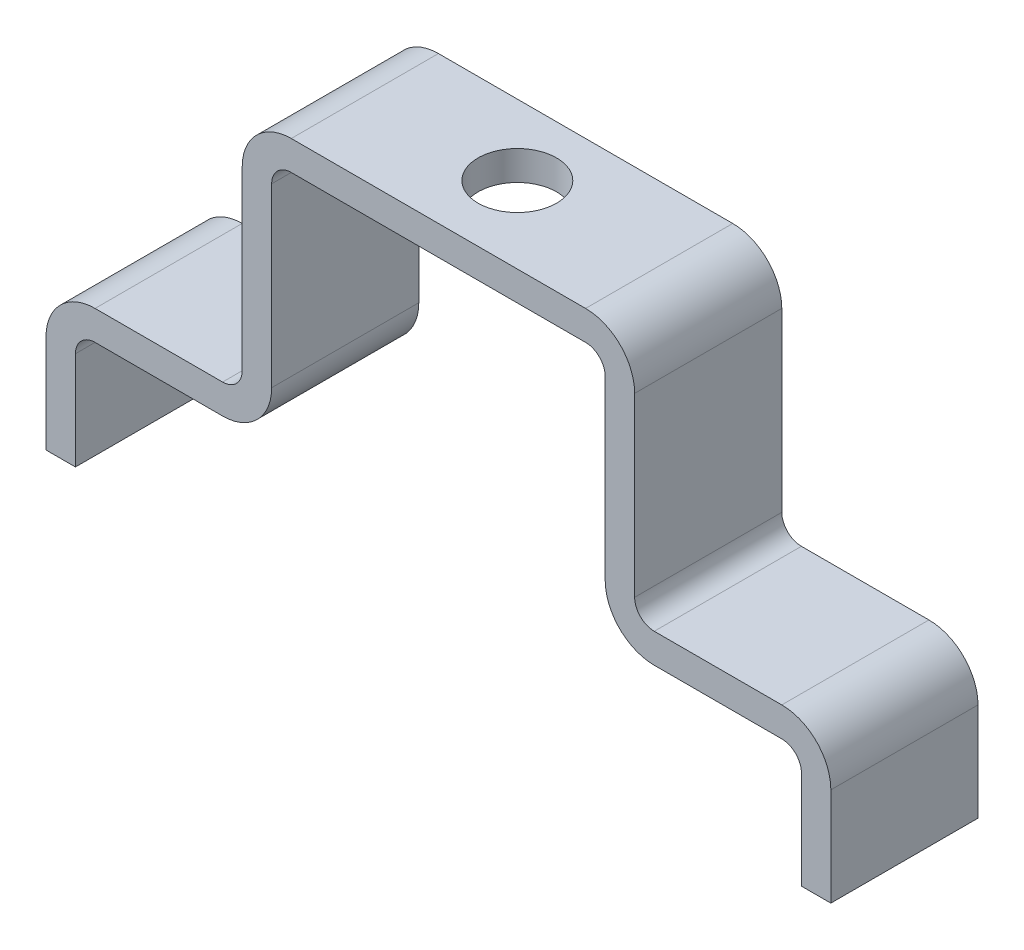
ISO-10303-21;
HEADER;
FILE_DESCRIPTION(('STEP AP214'),'2;1');
FILE_NAME('part.step','',(''),(''),'','','');
FILE_SCHEMA(('AUTOMOTIVE_DESIGN { 1 0 10303 214 1 1 1 1 }'));
ENDSEC;
DATA;
#1=APPLICATION_CONTEXT('core data for automotive mechanical design processes');
#2=APPLICATION_PROTOCOL_DEFINITION('international standard','automotive_design',2000,#1);
#3=PRODUCT_CONTEXT('',#1,'mechanical');
#4=PRODUCT('Part','Part','',(#3));
#5=PRODUCT_RELATED_PRODUCT_CATEGORY('part','',(#4));
#6=PRODUCT_DEFINITION_FORMATION('','',#4);
#7=PRODUCT_DEFINITION_CONTEXT('part definition',#1,'design');
#8=PRODUCT_DEFINITION('design','',#6,#7);
#9=PRODUCT_DEFINITION_SHAPE('','',#8);
#10=(LENGTH_UNIT() NAMED_UNIT(*) SI_UNIT(.MILLI.,.METRE.));
#11=(NAMED_UNIT(*) PLANE_ANGLE_UNIT() SI_UNIT($,.RADIAN.));
#12=(NAMED_UNIT(*) SI_UNIT($,.STERADIAN.) SOLID_ANGLE_UNIT());
#13=UNCERTAINTY_MEASURE_WITH_UNIT(LENGTH_MEASURE(1.E-05),#10,'distance_accuracy_value','');
#14=(GEOMETRIC_REPRESENTATION_CONTEXT(3) GLOBAL_UNCERTAINTY_ASSIGNED_CONTEXT((#13)) GLOBAL_UNIT_ASSIGNED_CONTEXT((#10,
#11,#12)) REPRESENTATION_CONTEXT('',''));
#15=CARTESIAN_POINT('',(0.,0.,0.));
#16=DIRECTION('',(0.,0.,1.));
#17=DIRECTION('',(1.,0.,0.));
#18=AXIS2_PLACEMENT_3D('',#15,#16,#17);
#19=CARTESIAN_POINT('',(32.0448336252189,-5.,15.));
#20=DIRECTION('',(1.,0.,0.));
#21=DIRECTION('',(0.,0.,-1.));
#22=AXIS2_PLACEMENT_3D('',#19,#20,#21);
#23=PLANE('',#22);
#24=DIRECTION('',(0.,1.,0.));
#25=VECTOR('',#24,1.);
#26=CARTESIAN_POINT('',(32.0448336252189,-5.,0.));
#27=LINE('',#26,#25);
#28=CARTESIAN_POINT('',(32.0448336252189,-5.,0.));
#29=VERTEX_POINT('',#28);
#30=CARTESIAN_POINT('',(32.0448336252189,-15.,0.));
#31=VERTEX_POINT('',#30);
#32=EDGE_CURVE('E224',#29,#31,#27,.F.);
#33=ORIENTED_EDGE('',*,*,#32,.T.);
#34=DIRECTION('',(0.,0.,-1.));
#35=VECTOR('',#34,1.);
#36=CARTESIAN_POINT('',(32.0448336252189,-15.,15.));
#37=LINE('',#36,#35);
#38=CARTESIAN_POINT('',(32.0448336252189,-15.,15.));
#39=VERTEX_POINT('',#38);
#40=EDGE_CURVE('E11',#39,#31,#37,.T.);
#41=ORIENTED_EDGE('',*,*,#40,.F.);
#42=DIRECTION('',(0.,1.,0.));
#43=VECTOR('',#42,1.);
#44=CARTESIAN_POINT('',(32.0448336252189,-5.,15.));
#45=LINE('',#44,#43);
#46=CARTESIAN_POINT('',(32.0448336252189,-5.,15.));
#47=VERTEX_POINT('',#46);
#48=EDGE_CURVE('E299',#47,#39,#45,.F.);
#49=ORIENTED_EDGE('',*,*,#48,.F.);
#50=DIRECTION('',(0.,0.,-1.));
#51=VECTOR('',#50,1.);
#52=CARTESIAN_POINT('',(32.0448336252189,-5.,15.));
#53=LINE('',#52,#51);
#54=EDGE_CURVE('E225',#47,#29,#53,.T.);
#55=ORIENTED_EDGE('',*,*,#54,.T.);
#56=EDGE_LOOP('',(#33,#41,#49,#55));
#57=FACE_BOUND('',#56,.T.);
#58=ADVANCED_FACE('F29',(#57),#23,.F.);
#59=CARTESIAN_POINT('',(35.0448336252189,-15.,15.));
#60=DIRECTION('',(0.,-1.,0.));
#61=DIRECTION('',(0.,0.,-1.));
#62=AXIS2_PLACEMENT_3D('',#59,#60,#61);
#63=PLANE('',#62);
#64=DIRECTION('',(-1.,0.,0.));
#65=VECTOR('',#64,1.);
#66=CARTESIAN_POINT('',(35.0448336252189,-15.,0.));
#67=LINE('',#66,#65);
#68=CARTESIAN_POINT('',(35.0448336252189,-15.,0.));
#69=VERTEX_POINT('',#68);
#70=EDGE_CURVE('E216',#69,#31,#67,.T.);
#71=ORIENTED_EDGE('',*,*,#70,.F.);
#72=DIRECTION('',(0.,0.,-1.));
#73=VECTOR('',#72,1.);
#74=CARTESIAN_POINT('',(35.0448336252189,-15.,15.));
#75=LINE('',#74,#73);
#76=CARTESIAN_POINT('',(35.0448336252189,-15.,15.));
#77=VERTEX_POINT('',#76);
#78=EDGE_CURVE('E37',#77,#69,#75,.T.);
#79=ORIENTED_EDGE('',*,*,#78,.F.);
#80=DIRECTION('',(-1.,0.,0.));
#81=VECTOR('',#80,1.);
#82=CARTESIAN_POINT('',(35.0448336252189,-15.,15.));
#83=LINE('',#82,#81);
#84=EDGE_CURVE('E219',#77,#39,#83,.T.);
#85=ORIENTED_EDGE('',*,*,#84,.T.);
#86=ORIENTED_EDGE('',*,*,#40,.T.);
#87=EDGE_LOOP('',(#71,#79,#85,#86));
#88=FACE_BOUND('',#87,.T.);
#89=ADVANCED_FACE('F214',(#88),#63,.T.);
#90=CARTESIAN_POINT('',(35.0448336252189,-5.,15.));
#91=DIRECTION('',(1.,0.,0.));
#92=DIRECTION('',(0.,0.,-1.));
#93=AXIS2_PLACEMENT_3D('',#90,#91,#92);
#94=PLANE('',#93);
#95=DIRECTION('',(0.,-1.,0.));
#96=VECTOR('',#95,1.);
#97=CARTESIAN_POINT('',(35.0448336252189,-5.,0.));
#98=LINE('',#97,#96);
#99=CARTESIAN_POINT('',(35.0448336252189,-5.,0.));
#100=VERTEX_POINT('',#99);
#101=EDGE_CURVE('E232',#100,#69,#98,.T.);
#102=ORIENTED_EDGE('',*,*,#101,.F.);
#103=DIRECTION('',(0.,0.,-1.));
#104=VECTOR('',#103,1.);
#105=CARTESIAN_POINT('',(35.0448336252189,-5.,15.));
#106=LINE('',#105,#104);
#107=CARTESIAN_POINT('',(35.0448336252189,-5.,15.));
#108=VERTEX_POINT('',#107);
#109=EDGE_CURVE('E426',#108,#100,#106,.T.);
#110=ORIENTED_EDGE('',*,*,#109,.F.);
#111=DIRECTION('',(0.,-1.,0.));
#112=VECTOR('',#111,1.);
#113=CARTESIAN_POINT('',(35.0448336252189,-5.,15.));
#114=LINE('',#113,#112);
#115=EDGE_CURVE('E302',#108,#77,#114,.T.);
#116=ORIENTED_EDGE('',*,*,#115,.T.);
#117=ORIENTED_EDGE('',*,*,#78,.T.);
#118=EDGE_LOOP('',(#102,#110,#116,#117));
#119=FACE_BOUND('',#118,.T.);
#120=ADVANCED_FACE('F429',(#119),#94,.T.);
#121=CARTESIAN_POINT('',(30.0448336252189,-5.,15.));
#122=DIRECTION('',(0.,0.,-1.));
#123=DIRECTION('',(-1.,0.,0.));
#124=AXIS2_PLACEMENT_3D('',#121,#122,#123);
#125=CYLINDRICAL_SURFACE('',#124,5.);
#126=CARTESIAN_POINT('',(30.0448336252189,-5.,0.));
#127=DIRECTION('',(0.,0.,-1.));
#128=DIRECTION('',(-1.,0.,0.));
#129=AXIS2_PLACEMENT_3D('',#126,#127,#128);
#130=CIRCLE('',#129,5.);
#131=CARTESIAN_POINT('',(30.0448336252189,0.,0.));
#132=VERTEX_POINT('',#131);
#133=EDGE_CURVE('E234',#132,#100,#130,.T.);
#134=ORIENTED_EDGE('',*,*,#133,.F.);
#135=DIRECTION('',(0.,0.,-1.));
#136=VECTOR('',#135,1.);
#137=CARTESIAN_POINT('',(30.0448336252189,0.,15.));
#138=LINE('',#137,#136);
#139=CARTESIAN_POINT('',(30.0448336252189,0.,15.));
#140=VERTEX_POINT('',#139);
#141=EDGE_CURVE('E424',#140,#132,#138,.T.);
#142=ORIENTED_EDGE('',*,*,#141,.F.);
#143=CARTESIAN_POINT('',(30.0448336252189,-5.,15.));
#144=DIRECTION('',(0.,0.,-1.));
#145=DIRECTION('',(-1.,0.,0.));
#146=AXIS2_PLACEMENT_3D('',#143,#144,#145);
#147=CIRCLE('',#146,5.);
#148=EDGE_CURVE('E305',#140,#108,#147,.T.);
#149=ORIENTED_EDGE('',*,*,#148,.T.);
#150=ORIENTED_EDGE('',*,*,#109,.T.);
#151=EDGE_LOOP('',(#134,#142,#149,#150));
#152=FACE_BOUND('',#151,.T.);
#153=ADVANCED_FACE('F436',(#152),#125,.T.);
#154=CARTESIAN_POINT('',(17.0448336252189,0.,15.));
#155=DIRECTION('',(0.,1.,0.));
#156=DIRECTION('',(0.,0.,1.));
#157=AXIS2_PLACEMENT_3D('',#154,#155,#156);
#158=PLANE('',#157);
#159=DIRECTION('',(1.,0.,0.));
#160=VECTOR('',#159,1.);
#161=CARTESIAN_POINT('',(17.0448336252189,0.,0.));
#162=LINE('',#161,#160);
#163=CARTESIAN_POINT('',(17.0448336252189,0.,0.));
#164=VERTEX_POINT('',#163);
#165=EDGE_CURVE('E239',#164,#132,#162,.T.);
#166=ORIENTED_EDGE('',*,*,#165,.F.);
#167=DIRECTION('',(0.,0.,-1.));
#168=VECTOR('',#167,1.);
#169=CARTESIAN_POINT('',(17.0448336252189,0.,15.));
#170=LINE('',#169,#168);
#171=CARTESIAN_POINT('',(17.0448336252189,0.,15.));
#172=VERTEX_POINT('',#171);
#173=EDGE_CURVE('E422',#172,#164,#170,.T.);
#174=ORIENTED_EDGE('',*,*,#173,.F.);
#175=DIRECTION('',(1.,0.,0.));
#176=VECTOR('',#175,1.);
#177=CARTESIAN_POINT('',(17.0448336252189,0.,15.));
#178=LINE('',#177,#176);
#179=EDGE_CURVE('E308',#172,#140,#178,.T.);
#180=ORIENTED_EDGE('',*,*,#179,.T.);
#181=ORIENTED_EDGE('',*,*,#141,.T.);
#182=EDGE_LOOP('',(#166,#174,#180,#181));
#183=FACE_BOUND('',#182,.T.);
#184=ADVANCED_FACE('F439',(#183),#158,.T.);
#185=CARTESIAN_POINT('',(17.0448336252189,2.,15.));
#186=DIRECTION('',(0.,0.,-1.));
#187=DIRECTION('',(-1.,0.,0.));
#188=AXIS2_PLACEMENT_3D('',#185,#186,#187);
#189=CYLINDRICAL_SURFACE('',#188,2.);
#190=CARTESIAN_POINT('',(17.0448336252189,2.,0.));
#191=DIRECTION('',(0.,0.,1.));
#192=DIRECTION('',(1.,0.,0.));
#193=AXIS2_PLACEMENT_3D('',#190,#191,#192);
#194=CIRCLE('',#193,2.);
#195=CARTESIAN_POINT('',(15.0448336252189,2.,0.));
#196=VERTEX_POINT('',#195);
#197=EDGE_CURVE('E242',#196,#164,#194,.T.);
#198=ORIENTED_EDGE('',*,*,#197,.F.);
#199=DIRECTION('',(0.,0.,-1.));
#200=VECTOR('',#199,1.);
#201=CARTESIAN_POINT('',(15.0448336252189,2.,15.));
#202=LINE('',#201,#200);
#203=CARTESIAN_POINT('',(15.0448336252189,2.,15.));
#204=VERTEX_POINT('',#203);
#205=EDGE_CURVE('E420',#204,#196,#202,.T.);
#206=ORIENTED_EDGE('',*,*,#205,.F.);
#207=CARTESIAN_POINT('',(17.0448336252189,2.,15.));
#208=DIRECTION('',(0.,0.,1.));
#209=DIRECTION('',(1.,0.,0.));
#210=AXIS2_PLACEMENT_3D('',#207,#208,#209);
#211=CIRCLE('',#210,2.);
#212=EDGE_CURVE('E311',#204,#172,#211,.T.);
#213=ORIENTED_EDGE('',*,*,#212,.T.);
#214=ORIENTED_EDGE('',*,*,#173,.T.);
#215=EDGE_LOOP('',(#198,#206,#213,#214));
#216=FACE_BOUND('',#215,.T.);
#217=ADVANCED_FACE('F444',(#216),#189,.F.);
#218=CARTESIAN_POINT('',(15.0448336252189,20.,15.));
#219=DIRECTION('',(1.,0.,0.));
#220=DIRECTION('',(0.,0.,-1.));
#221=AXIS2_PLACEMENT_3D('',#218,#219,#220);
#222=PLANE('',#221);
#223=DIRECTION('',(0.,-1.,0.));
#224=VECTOR('',#223,1.);
#225=CARTESIAN_POINT('',(15.0448336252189,20.,0.));
#226=LINE('',#225,#224);
#227=CARTESIAN_POINT('',(15.0448336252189,20.,0.));
#228=VERTEX_POINT('',#227);
#229=EDGE_CURVE('E245',#228,#196,#226,.T.);
#230=ORIENTED_EDGE('',*,*,#229,.F.);
#231=DIRECTION('',(0.,0.,-1.));
#232=VECTOR('',#231,1.);
#233=CARTESIAN_POINT('',(15.0448336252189,20.,15.));
#234=LINE('',#233,#232);
#235=CARTESIAN_POINT('',(15.0448336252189,20.,15.));
#236=VERTEX_POINT('',#235);
#237=EDGE_CURVE('E418',#236,#228,#234,.T.);
#238=ORIENTED_EDGE('',*,*,#237,.F.);
#239=DIRECTION('',(0.,-1.,0.));
#240=VECTOR('',#239,1.);
#241=CARTESIAN_POINT('',(15.0448336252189,20.,15.));
#242=LINE('',#241,#240);
#243=EDGE_CURVE('E314',#236,#204,#242,.T.);
#244=ORIENTED_EDGE('',*,*,#243,.T.);
#245=ORIENTED_EDGE('',*,*,#205,.T.);
#246=EDGE_LOOP('',(#230,#238,#244,#245));
#247=FACE_BOUND('',#246,.T.);
#248=ADVANCED_FACE('F447',(#247),#222,.T.);
#249=CARTESIAN_POINT('',(10.0448336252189,20.,15.));
#250=DIRECTION('',(0.,0.,-1.));
#251=DIRECTION('',(-1.,0.,0.));
#252=AXIS2_PLACEMENT_3D('',#249,#250,#251);
#253=CYLINDRICAL_SURFACE('',#252,5.);
#254=CARTESIAN_POINT('',(10.0448336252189,20.,0.));
#255=DIRECTION('',(0.,0.,-1.));
#256=DIRECTION('',(-1.,0.,0.));
#257=AXIS2_PLACEMENT_3D('',#254,#255,#256);
#258=CIRCLE('',#257,5.);
#259=CARTESIAN_POINT('',(10.0448336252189,25.,0.));
#260=VERTEX_POINT('',#259);
#261=EDGE_CURVE('E248',#260,#228,#258,.T.);
#262=ORIENTED_EDGE('',*,*,#261,.F.);
#263=DIRECTION('',(0.,0.,-1.));
#264=VECTOR('',#263,1.);
#265=CARTESIAN_POINT('',(10.0448336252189,25.,15.));
#266=LINE('',#265,#264);
#267=CARTESIAN_POINT('',(10.0448336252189,25.,15.));
#268=VERTEX_POINT('',#267);
#269=EDGE_CURVE('E416',#268,#260,#266,.T.);
#270=ORIENTED_EDGE('',*,*,#269,.F.);
#271=CARTESIAN_POINT('',(10.0448336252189,20.,15.));
#272=DIRECTION('',(0.,0.,-1.));
#273=DIRECTION('',(-1.,0.,0.));
#274=AXIS2_PLACEMENT_3D('',#271,#272,#273);
#275=CIRCLE('',#274,5.);
#276=EDGE_CURVE('E317',#268,#236,#275,.T.);
#277=ORIENTED_EDGE('',*,*,#276,.T.);
#278=ORIENTED_EDGE('',*,*,#237,.T.);
#279=EDGE_LOOP('',(#262,#270,#277,#278));
#280=FACE_BOUND('',#279,.T.);
#281=ADVANCED_FACE('F452',(#280),#253,.T.);
#282=CARTESIAN_POINT('',(-19.9551663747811,25.,15.));
#283=DIRECTION('',(0.,1.,0.));
#284=DIRECTION('',(0.,0.,1.));
#285=AXIS2_PLACEMENT_3D('',#282,#283,#284);
#286=PLANE('',#285);
#287=CARTESIAN_POINT('',(-4.7216579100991,25.,7.18865538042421));
#288=DIRECTION('',(0.,1.,0.));
#289=DIRECTION('',(0.,0.,1.));
#290=AXIS2_PLACEMENT_3D('',#287,#288,#289);
#291=CIRCLE('',#290,4.);
#292=CARTESIAN_POINT('',(-4.7216579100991,25.,11.1886553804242));
#293=VERTEX_POINT('',#292);
#294=EDGE_CURVE('E730',#293,#293,#291,.T.);
#295=ORIENTED_EDGE('',*,*,#294,.F.);
#296=EDGE_LOOP('',(#295));
#297=FACE_BOUND('',#296,.T.);
#298=DIRECTION('',(1.,0.,0.));
#299=VECTOR('',#298,1.);
#300=CARTESIAN_POINT('',(-19.9551663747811,25.,0.));
#301=LINE('',#300,#299);
#302=CARTESIAN_POINT('',(-19.9551663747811,25.,0.));
#303=VERTEX_POINT('',#302);
#304=EDGE_CURVE('E251',#303,#260,#301,.T.);
#305=ORIENTED_EDGE('',*,*,#304,.F.);
#306=DIRECTION('',(0.,0.,-1.));
#307=VECTOR('',#306,1.);
#308=CARTESIAN_POINT('',(-19.9551663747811,25.,15.));
#309=LINE('',#308,#307);
#310=CARTESIAN_POINT('',(-19.9551663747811,25.,15.));
#311=VERTEX_POINT('',#310);
#312=EDGE_CURVE('E414',#311,#303,#309,.T.);
#313=ORIENTED_EDGE('',*,*,#312,.F.);
#314=DIRECTION('',(1.,0.,0.));
#315=VECTOR('',#314,1.);
#316=CARTESIAN_POINT('',(-19.9551663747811,25.,15.));
#317=LINE('',#316,#315);
#318=EDGE_CURVE('E320',#311,#268,#317,.T.);
#319=ORIENTED_EDGE('',*,*,#318,.T.);
#320=ORIENTED_EDGE('',*,*,#269,.T.);
#321=EDGE_LOOP('',(#305,#313,#319,#320));
#322=FACE_BOUND('',#321,.T.);
#323=ADVANCED_FACE('F455',(#297,#322),#286,.T.);
#324=CARTESIAN_POINT('',(-19.9551663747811,20.,15.));
#325=DIRECTION('',(0.,0.,-1.));
#326=DIRECTION('',(-1.,0.,0.));
#327=AXIS2_PLACEMENT_3D('',#324,#325,#326);
#328=CYLINDRICAL_SURFACE('',#327,5.);
#329=CARTESIAN_POINT('',(-19.9551663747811,20.,0.));
#330=DIRECTION('',(0.,0.,-1.));
#331=DIRECTION('',(1.,0.,0.));
#332=AXIS2_PLACEMENT_3D('',#329,#330,#331);
#333=CIRCLE('',#332,5.);
#334=CARTESIAN_POINT('',(-24.9551663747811,20.,0.));
#335=VERTEX_POINT('',#334);
#336=EDGE_CURVE('E254',#335,#303,#333,.T.);
#337=ORIENTED_EDGE('',*,*,#336,.F.);
#338=DIRECTION('',(0.,0.,-1.));
#339=VECTOR('',#338,1.);
#340=CARTESIAN_POINT('',(-24.9551663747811,20.,15.));
#341=LINE('',#340,#339);
#342=CARTESIAN_POINT('',(-24.9551663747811,20.,15.));
#343=VERTEX_POINT('',#342);
#344=EDGE_CURVE('E412',#343,#335,#341,.T.);
#345=ORIENTED_EDGE('',*,*,#344,.F.);
#346=CARTESIAN_POINT('',(-19.9551663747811,20.,15.));
#347=DIRECTION('',(0.,0.,-1.));
#348=DIRECTION('',(1.,0.,0.));
#349=AXIS2_PLACEMENT_3D('',#346,#347,#348);
#350=CIRCLE('',#349,5.);
#351=EDGE_CURVE('E323',#343,#311,#350,.T.);
#352=ORIENTED_EDGE('',*,*,#351,.T.);
#353=ORIENTED_EDGE('',*,*,#312,.T.);
#354=EDGE_LOOP('',(#337,#345,#352,#353));
#355=FACE_BOUND('',#354,.T.);
#356=ADVANCED_FACE('F460',(#355),#328,.T.);
#357=CARTESIAN_POINT('',(-24.9551663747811,20.,15.));
#358=DIRECTION('',(-1.,0.,0.));
#359=DIRECTION('',(0.,0.,1.));
#360=AXIS2_PLACEMENT_3D('',#357,#358,#359);
#361=PLANE('',#360);
#362=DIRECTION('',(0.,1.,0.));
#363=VECTOR('',#362,1.);
#364=CARTESIAN_POINT('',(-24.9551663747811,20.,0.));
#365=LINE('',#364,#363);
#366=CARTESIAN_POINT('',(-24.9551663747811,2.,0.));
#367=VERTEX_POINT('',#366);
#368=EDGE_CURVE('E257',#367,#335,#365,.T.);
#369=ORIENTED_EDGE('',*,*,#368,.F.);
#370=DIRECTION('',(0.,0.,-1.));
#371=VECTOR('',#370,1.);
#372=CARTESIAN_POINT('',(-24.9551663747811,2.,15.));
#373=LINE('',#372,#371);
#374=CARTESIAN_POINT('',(-24.9551663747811,2.,15.));
#375=VERTEX_POINT('',#374);
#376=EDGE_CURVE('E410',#375,#367,#373,.T.);
#377=ORIENTED_EDGE('',*,*,#376,.F.);
#378=DIRECTION('',(0.,1.,0.));
#379=VECTOR('',#378,1.);
#380=CARTESIAN_POINT('',(-24.9551663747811,20.,15.));
#381=LINE('',#380,#379);
#382=EDGE_CURVE('E326',#375,#343,#381,.T.);
#383=ORIENTED_EDGE('',*,*,#382,.T.);
#384=ORIENTED_EDGE('',*,*,#344,.T.);
#385=EDGE_LOOP('',(#369,#377,#383,#384));
#386=FACE_BOUND('',#385,.T.);
#387=ADVANCED_FACE('F463',(#386),#361,.T.);
#388=CARTESIAN_POINT('',(-26.9551663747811,2.,15.));
#389=DIRECTION('',(0.,0.,-1.));
#390=DIRECTION('',(-1.,0.,0.));
#391=AXIS2_PLACEMENT_3D('',#388,#389,#390);
#392=CYLINDRICAL_SURFACE('',#391,2.);
#393=CARTESIAN_POINT('',(-26.9551663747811,2.,0.));
#394=DIRECTION('',(0.,0.,1.));
#395=DIRECTION('',(-1.,0.,0.));
#396=AXIS2_PLACEMENT_3D('',#393,#394,#395);
#397=CIRCLE('',#396,2.);
#398=CARTESIAN_POINT('',(-26.9551663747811,0.,0.));
#399=VERTEX_POINT('',#398);
#400=EDGE_CURVE('E260',#399,#367,#397,.T.);
#401=ORIENTED_EDGE('',*,*,#400,.F.);
#402=DIRECTION('',(0.,0.,-1.));
#403=VECTOR('',#402,1.);
#404=CARTESIAN_POINT('',(-26.9551663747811,0.,15.));
#405=LINE('',#404,#403);
#406=CARTESIAN_POINT('',(-26.9551663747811,0.,15.));
#407=VERTEX_POINT('',#406);
#408=EDGE_CURVE('E408',#407,#399,#405,.T.);
#409=ORIENTED_EDGE('',*,*,#408,.F.);
#410=CARTESIAN_POINT('',(-26.9551663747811,2.,15.));
#411=DIRECTION('',(0.,0.,1.));
#412=DIRECTION('',(-1.,0.,0.));
#413=AXIS2_PLACEMENT_3D('',#410,#411,#412);
#414=CIRCLE('',#413,2.);
#415=EDGE_CURVE('E329',#407,#375,#414,.T.);
#416=ORIENTED_EDGE('',*,*,#415,.T.);
#417=ORIENTED_EDGE('',*,*,#376,.T.);
#418=EDGE_LOOP('',(#401,#409,#416,#417));
#419=FACE_BOUND('',#418,.T.);
#420=ADVANCED_FACE('F468',(#419),#392,.F.);
#421=CARTESIAN_POINT('',(-26.9551663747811,0.,15.));
#422=DIRECTION('',(0.,1.,0.));
#423=DIRECTION('',(0.,0.,1.));
#424=AXIS2_PLACEMENT_3D('',#421,#422,#423);
#425=PLANE('',#424);
#426=DIRECTION('',(1.,0.,0.));
#427=VECTOR('',#426,1.);
#428=CARTESIAN_POINT('',(-26.9551663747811,0.,0.));
#429=LINE('',#428,#427);
#430=CARTESIAN_POINT('',(-39.9551663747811,0.,0.));
#431=VERTEX_POINT('',#430);
#432=EDGE_CURVE('E263',#431,#399,#429,.T.);
#433=ORIENTED_EDGE('',*,*,#432,.F.);
#434=DIRECTION('',(0.,0.,-1.));
#435=VECTOR('',#434,1.);
#436=CARTESIAN_POINT('',(-39.9551663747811,0.,15.));
#437=LINE('',#436,#435);
#438=CARTESIAN_POINT('',(-39.9551663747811,0.,15.));
#439=VERTEX_POINT('',#438);
#440=EDGE_CURVE('E406',#439,#431,#437,.T.);
#441=ORIENTED_EDGE('',*,*,#440,.F.);
#442=DIRECTION('',(1.,0.,0.));
#443=VECTOR('',#442,1.);
#444=CARTESIAN_POINT('',(-26.9551663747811,0.,15.));
#445=LINE('',#444,#443);
#446=EDGE_CURVE('E332',#439,#407,#445,.T.);
#447=ORIENTED_EDGE('',*,*,#446,.T.);
#448=ORIENTED_EDGE('',*,*,#408,.T.);
#449=EDGE_LOOP('',(#433,#441,#447,#448));
#450=FACE_BOUND('',#449,.T.);
#451=ADVANCED_FACE('F471',(#450),#425,.T.);
#452=CARTESIAN_POINT('',(-39.9551663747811,-5.,15.));
#453=DIRECTION('',(0.,0.,-1.));
#454=DIRECTION('',(-1.,0.,0.));
#455=AXIS2_PLACEMENT_3D('',#452,#453,#454);
#456=CYLINDRICAL_SURFACE('',#455,5.);
#457=CARTESIAN_POINT('',(-39.9551663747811,-5.,0.));
#458=DIRECTION('',(0.,0.,-1.));
#459=DIRECTION('',(1.,0.,0.));
#460=AXIS2_PLACEMENT_3D('',#457,#458,#459);
#461=CIRCLE('',#460,5.);
#462=CARTESIAN_POINT('',(-44.9551663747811,-5.,0.));
#463=VERTEX_POINT('',#462);
#464=EDGE_CURVE('E266',#463,#431,#461,.T.);
#465=ORIENTED_EDGE('',*,*,#464,.F.);
#466=DIRECTION('',(0.,0.,-1.));
#467=VECTOR('',#466,1.);
#468=CARTESIAN_POINT('',(-44.9551663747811,-5.,15.));
#469=LINE('',#468,#467);
#470=CARTESIAN_POINT('',(-44.9551663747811,-5.,15.));
#471=VERTEX_POINT('',#470);
#472=EDGE_CURVE('E404',#471,#463,#469,.T.);
#473=ORIENTED_EDGE('',*,*,#472,.F.);
#474=CARTESIAN_POINT('',(-39.9551663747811,-5.,15.));
#475=DIRECTION('',(0.,0.,-1.));
#476=DIRECTION('',(1.,0.,0.));
#477=AXIS2_PLACEMENT_3D('',#474,#475,#476);
#478=CIRCLE('',#477,5.);
#479=EDGE_CURVE('E335',#471,#439,#478,.T.);
#480=ORIENTED_EDGE('',*,*,#479,.T.);
#481=ORIENTED_EDGE('',*,*,#440,.T.);
#482=EDGE_LOOP('',(#465,#473,#480,#481));
#483=FACE_BOUND('',#482,.T.);
#484=ADVANCED_FACE('F476',(#483),#456,.T.);
#485=CARTESIAN_POINT('',(-44.9551663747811,-5.,15.));
#486=DIRECTION('',(-1.,0.,0.));
#487=DIRECTION('',(0.,0.,1.));
#488=AXIS2_PLACEMENT_3D('',#485,#486,#487);
#489=PLANE('',#488);
#490=DIRECTION('',(0.,1.,0.));
#491=VECTOR('',#490,1.);
#492=CARTESIAN_POINT('',(-44.9551663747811,-5.,0.));
#493=LINE('',#492,#491);
#494=CARTESIAN_POINT('',(-44.9551663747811,-15.,0.));
#495=VERTEX_POINT('',#494);
#496=EDGE_CURVE('E269',#495,#463,#493,.T.);
#497=ORIENTED_EDGE('',*,*,#496,.F.);
#498=DIRECTION('',(0.,0.,-1.));
#499=VECTOR('',#498,1.);
#500=CARTESIAN_POINT('',(-44.9551663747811,-15.,15.));
#501=LINE('',#500,#499);
#502=CARTESIAN_POINT('',(-44.9551663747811,-15.,15.));
#503=VERTEX_POINT('',#502);
#504=EDGE_CURVE('E402',#503,#495,#501,.T.);
#505=ORIENTED_EDGE('',*,*,#504,.F.);
#506=DIRECTION('',(0.,1.,0.));
#507=VECTOR('',#506,1.);
#508=CARTESIAN_POINT('',(-44.9551663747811,-5.,15.));
#509=LINE('',#508,#507);
#510=EDGE_CURVE('E338',#503,#471,#509,.T.);
#511=ORIENTED_EDGE('',*,*,#510,.T.);
#512=ORIENTED_EDGE('',*,*,#472,.T.);
#513=EDGE_LOOP('',(#497,#505,#511,#512));
#514=FACE_BOUND('',#513,.T.);
#515=ADVANCED_FACE('F479',(#514),#489,.T.);
#516=CARTESIAN_POINT('',(-41.9551663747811,-15.,15.));
#517=DIRECTION('',(0.,-1.,0.));
#518=DIRECTION('',(1.,0.,0.));
#519=AXIS2_PLACEMENT_3D('',#516,#517,#518);
#520=PLANE('',#519);
#521=DIRECTION('',(-1.,0.,0.));
#522=VECTOR('',#521,1.);
#523=CARTESIAN_POINT('',(-41.9551663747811,-15.,0.));
#524=LINE('',#523,#522);
#525=CARTESIAN_POINT('',(-41.9551663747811,-15.,0.));
#526=VERTEX_POINT('',#525);
#527=EDGE_CURVE('E272',#526,#495,#524,.T.);
#528=ORIENTED_EDGE('',*,*,#527,.F.);
#529=DIRECTION('',(0.,0.,-1.));
#530=VECTOR('',#529,1.);
#531=CARTESIAN_POINT('',(-41.9551663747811,-15.,15.));
#532=LINE('',#531,#530);
#533=CARTESIAN_POINT('',(-41.9551663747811,-15.,15.));
#534=VERTEX_POINT('',#533);
#535=EDGE_CURVE('E400',#534,#526,#532,.T.);
#536=ORIENTED_EDGE('',*,*,#535,.F.);
#537=DIRECTION('',(-1.,0.,0.));
#538=VECTOR('',#537,1.);
#539=CARTESIAN_POINT('',(-41.9551663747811,-15.,15.));
#540=LINE('',#539,#538);
#541=EDGE_CURVE('E341',#534,#503,#540,.T.);
#542=ORIENTED_EDGE('',*,*,#541,.T.);
#543=ORIENTED_EDGE('',*,*,#504,.T.);
#544=EDGE_LOOP('',(#528,#536,#542,#543));
#545=FACE_BOUND('',#544,.T.);
#546=ADVANCED_FACE('F483',(#545),#520,.T.);
#547=CARTESIAN_POINT('',(-41.9551663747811,-5.,15.));
#548=DIRECTION('',(-1.,0.,0.));
#549=DIRECTION('',(0.,0.,1.));
#550=AXIS2_PLACEMENT_3D('',#547,#548,#549);
#551=PLANE('',#550);
#552=DIRECTION('',(0.,1.,0.));
#553=VECTOR('',#552,1.);
#554=CARTESIAN_POINT('',(-41.9551663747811,-5.,0.));
#555=LINE('',#554,#553);
#556=CARTESIAN_POINT('',(-41.9551663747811,-5.,0.));
#557=VERTEX_POINT('',#556);
#558=EDGE_CURVE('E275',#526,#557,#555,.T.);
#559=ORIENTED_EDGE('',*,*,#558,.T.);
#560=DIRECTION('',(0.,0.,-1.));
#561=VECTOR('',#560,1.);
#562=CARTESIAN_POINT('',(-41.9551663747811,-5.,15.));
#563=LINE('',#562,#561);
#564=CARTESIAN_POINT('',(-41.9551663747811,-5.,15.));
#565=VERTEX_POINT('',#564);
#566=EDGE_CURVE('E397',#565,#557,#563,.T.);
#567=ORIENTED_EDGE('',*,*,#566,.F.);
#568=DIRECTION('',(0.,1.,0.));
#569=VECTOR('',#568,1.);
#570=CARTESIAN_POINT('',(-41.9551663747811,-5.,15.));
#571=LINE('',#570,#569);
#572=EDGE_CURVE('E344',#534,#565,#571,.T.);
#573=ORIENTED_EDGE('',*,*,#572,.F.);
#574=ORIENTED_EDGE('',*,*,#535,.T.);
#575=EDGE_LOOP('',(#559,#567,#573,#574));
#576=FACE_BOUND('',#575,.T.);
#577=ADVANCED_FACE('F488',(#576),#551,.F.);
#578=CARTESIAN_POINT('',(-39.9551663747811,-5.,15.));
#579=DIRECTION('',(0.,0.,-1.));
#580=DIRECTION('',(-1.,0.,0.));
#581=AXIS2_PLACEMENT_3D('',#578,#579,#580);
#582=CYLINDRICAL_SURFACE('',#581,2.);
#583=CARTESIAN_POINT('',(-39.9551663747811,-5.,0.));
#584=DIRECTION('',(0.,0.,1.));
#585=DIRECTION('',(1.,0.,0.));
#586=AXIS2_PLACEMENT_3D('',#583,#584,#585);
#587=CIRCLE('',#586,2.);
#588=CARTESIAN_POINT('',(-39.9551663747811,-3.,0.));
#589=VERTEX_POINT('',#588);
#590=EDGE_CURVE('E277',#557,#589,#587,.F.);
#591=ORIENTED_EDGE('',*,*,#590,.T.);
#592=DIRECTION('',(0.,0.,-1.));
#593=VECTOR('',#592,1.);
#594=CARTESIAN_POINT('',(-39.9551663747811,-3.,15.));
#595=LINE('',#594,#593);
#596=CARTESIAN_POINT('',(-39.9551663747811,-3.,15.));
#597=VERTEX_POINT('',#596);
#598=EDGE_CURVE('E394',#597,#589,#595,.T.);
#599=ORIENTED_EDGE('',*,*,#598,.F.);
#600=CARTESIAN_POINT('',(-39.9551663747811,-5.,15.));
#601=DIRECTION('',(0.,0.,1.));
#602=DIRECTION('',(1.,0.,0.));
#603=AXIS2_PLACEMENT_3D('',#600,#601,#602);
#604=CIRCLE('',#603,2.);
#605=EDGE_CURVE('E346',#565,#597,#604,.F.);
#606=ORIENTED_EDGE('',*,*,#605,.F.);
#607=ORIENTED_EDGE('',*,*,#566,.T.);
#608=EDGE_LOOP('',(#591,#599,#606,#607));
#609=FACE_BOUND('',#608,.T.);
#610=ADVANCED_FACE('F494',(#609),#582,.F.);
#611=CARTESIAN_POINT('',(-26.9551663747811,-3.,15.));
#612=DIRECTION('',(0.,1.,0.));
#613=DIRECTION('',(0.,0.,1.));
#614=AXIS2_PLACEMENT_3D('',#611,#612,#613);
#615=PLANE('',#614);
#616=DIRECTION('',(1.,0.,0.));
#617=VECTOR('',#616,1.);
#618=CARTESIAN_POINT('',(-26.9551663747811,-3.,0.));
#619=LINE('',#618,#617);
#620=CARTESIAN_POINT('',(-26.9551663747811,-3.,0.));
#621=VERTEX_POINT('',#620);
#622=EDGE_CURVE('E279',#589,#621,#619,.T.);
#623=ORIENTED_EDGE('',*,*,#622,.T.);
#624=DIRECTION('',(0.,0.,-1.));
#625=VECTOR('',#624,1.);
#626=CARTESIAN_POINT('',(-26.9551663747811,-3.,15.));
#627=LINE('',#626,#625);
#628=CARTESIAN_POINT('',(-26.9551663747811,-3.,15.));
#629=VERTEX_POINT('',#628);
#630=EDGE_CURVE('E391',#629,#621,#627,.T.);
#631=ORIENTED_EDGE('',*,*,#630,.F.);
#632=DIRECTION('',(1.,0.,0.));
#633=VECTOR('',#632,1.);
#634=CARTESIAN_POINT('',(-26.9551663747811,-3.,15.));
#635=LINE('',#634,#633);
#636=EDGE_CURVE('E348',#597,#629,#635,.T.);
#637=ORIENTED_EDGE('',*,*,#636,.F.);
#638=ORIENTED_EDGE('',*,*,#598,.T.);
#639=EDGE_LOOP('',(#623,#631,#637,#638));
#640=FACE_BOUND('',#639,.T.);
#641=ADVANCED_FACE('F498',(#640),#615,.F.);
#642=CARTESIAN_POINT('',(-26.9551663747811,2.,15.));
#643=DIRECTION('',(0.,0.,-1.));
#644=DIRECTION('',(-1.,0.,0.));
#645=AXIS2_PLACEMENT_3D('',#642,#643,#644);
#646=CYLINDRICAL_SURFACE('',#645,5.);
#647=CARTESIAN_POINT('',(-26.9551663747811,2.,0.));
#648=DIRECTION('',(0.,0.,1.));
#649=DIRECTION('',(1.,0.,0.));
#650=AXIS2_PLACEMENT_3D('',#647,#648,#649);
#651=CIRCLE('',#650,5.);
#652=CARTESIAN_POINT('',(-21.9551663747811,2.,0.));
#653=VERTEX_POINT('',#652);
#654=EDGE_CURVE('E281',#621,#653,#651,.T.);
#655=ORIENTED_EDGE('',*,*,#654,.T.);
#656=DIRECTION('',(0.,0.,-1.));
#657=VECTOR('',#656,1.);
#658=CARTESIAN_POINT('',(-21.9551663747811,2.,15.));
#659=LINE('',#658,#657);
#660=CARTESIAN_POINT('',(-21.9551663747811,2.,15.));
#661=VERTEX_POINT('',#660);
#662=EDGE_CURVE('E388',#661,#653,#659,.T.);
#663=ORIENTED_EDGE('',*,*,#662,.F.);
#664=CARTESIAN_POINT('',(-26.9551663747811,2.,15.));
#665=DIRECTION('',(0.,0.,1.));
#666=DIRECTION('',(1.,0.,0.));
#667=AXIS2_PLACEMENT_3D('',#664,#665,#666);
#668=CIRCLE('',#667,5.);
#669=EDGE_CURVE('E350',#629,#661,#668,.T.);
#670=ORIENTED_EDGE('',*,*,#669,.F.);
#671=ORIENTED_EDGE('',*,*,#630,.T.);
#672=EDGE_LOOP('',(#655,#663,#670,#671));
#673=FACE_BOUND('',#672,.T.);
#674=ADVANCED_FACE('F503',(#673),#646,.T.);
#675=CARTESIAN_POINT('',(-21.9551663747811,20.,15.));
#676=DIRECTION('',(-1.,0.,0.));
#677=DIRECTION('',(0.,0.,1.));
#678=AXIS2_PLACEMENT_3D('',#675,#676,#677);
#679=PLANE('',#678);
#680=DIRECTION('',(0.,1.,0.));
#681=VECTOR('',#680,1.);
#682=CARTESIAN_POINT('',(-21.9551663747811,20.,0.));
#683=LINE('',#682,#681);
#684=CARTESIAN_POINT('',(-21.9551663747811,20.,0.));
#685=VERTEX_POINT('',#684);
#686=EDGE_CURVE('E283',#653,#685,#683,.T.);
#687=ORIENTED_EDGE('',*,*,#686,.T.);
#688=DIRECTION('',(0.,0.,-1.));
#689=VECTOR('',#688,1.);
#690=CARTESIAN_POINT('',(-21.9551663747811,20.,15.));
#691=LINE('',#690,#689);
#692=CARTESIAN_POINT('',(-21.9551663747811,20.,15.));
#693=VERTEX_POINT('',#692);
#694=EDGE_CURVE('E385',#693,#685,#691,.T.);
#695=ORIENTED_EDGE('',*,*,#694,.F.);
#696=DIRECTION('',(0.,1.,0.));
#697=VECTOR('',#696,1.);
#698=CARTESIAN_POINT('',(-21.9551663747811,20.,15.));
#699=LINE('',#698,#697);
#700=EDGE_CURVE('E352',#661,#693,#699,.T.);
#701=ORIENTED_EDGE('',*,*,#700,.F.);
#702=ORIENTED_EDGE('',*,*,#662,.T.);
#703=EDGE_LOOP('',(#687,#695,#701,#702));
#704=FACE_BOUND('',#703,.T.);
#705=ADVANCED_FACE('F509',(#704),#679,.F.);
#706=CARTESIAN_POINT('',(-19.9551663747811,20.,15.));
#707=DIRECTION('',(0.,0.,-1.));
#708=DIRECTION('',(-1.,0.,0.));
#709=AXIS2_PLACEMENT_3D('',#706,#707,#708);
#710=CYLINDRICAL_SURFACE('',#709,2.);
#711=CARTESIAN_POINT('',(-19.9551663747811,20.,0.));
#712=DIRECTION('',(0.,0.,1.));
#713=DIRECTION('',(1.,0.,0.));
#714=AXIS2_PLACEMENT_3D('',#711,#712,#713);
#715=CIRCLE('',#714,2.);
#716=CARTESIAN_POINT('',(-19.9551663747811,22.,0.));
#717=VERTEX_POINT('',#716);
#718=EDGE_CURVE('E285',#685,#717,#715,.F.);
#719=ORIENTED_EDGE('',*,*,#718,.T.);
#720=DIRECTION('',(0.,0.,-1.));
#721=VECTOR('',#720,1.);
#722=CARTESIAN_POINT('',(-19.9551663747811,22.,15.));
#723=LINE('',#722,#721);
#724=CARTESIAN_POINT('',(-19.9551663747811,22.,15.));
#725=VERTEX_POINT('',#724);
#726=EDGE_CURVE('E382',#725,#717,#723,.T.);
#727=ORIENTED_EDGE('',*,*,#726,.F.);
#728=CARTESIAN_POINT('',(-19.9551663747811,20.,15.));
#729=DIRECTION('',(0.,0.,1.));
#730=DIRECTION('',(1.,0.,0.));
#731=AXIS2_PLACEMENT_3D('',#728,#729,#730);
#732=CIRCLE('',#731,2.);
#733=EDGE_CURVE('E354',#693,#725,#732,.F.);
#734=ORIENTED_EDGE('',*,*,#733,.F.);
#735=ORIENTED_EDGE('',*,*,#694,.T.);
#736=EDGE_LOOP('',(#719,#727,#734,#735));
#737=FACE_BOUND('',#736,.T.);
#738=ADVANCED_FACE('F513',(#737),#710,.F.);
#739=CARTESIAN_POINT('',(-19.9551663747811,22.,15.));
#740=DIRECTION('',(0.,1.,0.));
#741=DIRECTION('',(0.,0.,1.));
#742=AXIS2_PLACEMENT_3D('',#739,#740,#741);
#743=PLANE('',#742);
#744=CARTESIAN_POINT('',(-4.7216579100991,22.,7.18865538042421));
#745=DIRECTION('',(0.,1.,0.));
#746=DIRECTION('',(0.,0.,1.));
#747=AXIS2_PLACEMENT_3D('',#744,#745,#746);
#748=CIRCLE('',#747,4.);
#749=CARTESIAN_POINT('',(-4.7216579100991,22.,11.1886553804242));
#750=VERTEX_POINT('',#749);
#751=EDGE_CURVE('E32',#750,#750,#748,.T.);
#752=ORIENTED_EDGE('',*,*,#751,.T.);
#753=EDGE_LOOP('',(#752));
#754=FACE_BOUND('',#753,.T.);
#755=DIRECTION('',(1.,0.,0.));
#756=VECTOR('',#755,1.);
#757=CARTESIAN_POINT('',(-19.9551663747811,22.,0.));
#758=LINE('',#757,#756);
#759=CARTESIAN_POINT('',(10.0448336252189,22.,0.));
#760=VERTEX_POINT('',#759);
#761=EDGE_CURVE('E287',#717,#760,#758,.T.);
#762=ORIENTED_EDGE('',*,*,#761,.T.);
#763=DIRECTION('',(0.,0.,-1.));
#764=VECTOR('',#763,1.);
#765=CARTESIAN_POINT('',(10.0448336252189,22.,15.));
#766=LINE('',#765,#764);
#767=CARTESIAN_POINT('',(10.0448336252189,22.,15.));
#768=VERTEX_POINT('',#767);
#769=EDGE_CURVE('E379',#768,#760,#766,.T.);
#770=ORIENTED_EDGE('',*,*,#769,.F.);
#771=DIRECTION('',(1.,0.,0.));
#772=VECTOR('',#771,1.);
#773=CARTESIAN_POINT('',(-19.9551663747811,22.,15.));
#774=LINE('',#773,#772);
#775=EDGE_CURVE('E356',#725,#768,#774,.T.);
#776=ORIENTED_EDGE('',*,*,#775,.F.);
#777=ORIENTED_EDGE('',*,*,#726,.T.);
#778=EDGE_LOOP('',(#762,#770,#776,#777));
#779=FACE_BOUND('',#778,.T.);
#780=ADVANCED_FACE('F518',(#754,#779),#743,.F.);
#781=CARTESIAN_POINT('',(10.0448336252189,20.,15.));
#782=DIRECTION('',(0.,0.,-1.));
#783=DIRECTION('',(-1.,0.,0.));
#784=AXIS2_PLACEMENT_3D('',#781,#782,#783);
#785=CYLINDRICAL_SURFACE('',#784,2.);
#786=CARTESIAN_POINT('',(10.0448336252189,20.,0.));
#787=DIRECTION('',(0.,0.,1.));
#788=DIRECTION('',(1.,0.,0.));
#789=AXIS2_PLACEMENT_3D('',#786,#787,#788);
#790=CIRCLE('',#789,2.);
#791=CARTESIAN_POINT('',(12.0448336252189,20.,0.));
#792=VERTEX_POINT('',#791);
#793=EDGE_CURVE('E289',#760,#792,#790,.F.);
#794=ORIENTED_EDGE('',*,*,#793,.T.);
#795=DIRECTION('',(0.,0.,-1.));
#796=VECTOR('',#795,1.);
#797=CARTESIAN_POINT('',(12.0448336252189,20.,15.));
#798=LINE('',#797,#796);
#799=CARTESIAN_POINT('',(12.0448336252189,20.,15.));
#800=VERTEX_POINT('',#799);
#801=EDGE_CURVE('E376',#800,#792,#798,.T.);
#802=ORIENTED_EDGE('',*,*,#801,.F.);
#803=CARTESIAN_POINT('',(10.0448336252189,20.,15.));
#804=DIRECTION('',(0.,0.,1.));
#805=DIRECTION('',(1.,0.,0.));
#806=AXIS2_PLACEMENT_3D('',#803,#804,#805);
#807=CIRCLE('',#806,2.);
#808=EDGE_CURVE('E358',#768,#800,#807,.F.);
#809=ORIENTED_EDGE('',*,*,#808,.F.);
#810=ORIENTED_EDGE('',*,*,#769,.T.);
#811=EDGE_LOOP('',(#794,#802,#809,#810));
#812=FACE_BOUND('',#811,.T.);
#813=ADVANCED_FACE('F524',(#812),#785,.F.);
#814=CARTESIAN_POINT('',(12.0448336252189,20.,15.));
#815=DIRECTION('',(1.,0.,0.));
#816=DIRECTION('',(0.,0.,-1.));
#817=AXIS2_PLACEMENT_3D('',#814,#815,#816);
#818=PLANE('',#817);
#819=DIRECTION('',(0.,1.,0.));
#820=VECTOR('',#819,1.);
#821=CARTESIAN_POINT('',(12.0448336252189,20.,0.));
#822=LINE('',#821,#820);
#823=CARTESIAN_POINT('',(12.0448336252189,2.,0.));
#824=VERTEX_POINT('',#823);
#825=EDGE_CURVE('E291',#792,#824,#822,.F.);
#826=ORIENTED_EDGE('',*,*,#825,.T.);
#827=DIRECTION('',(0.,0.,-1.));
#828=VECTOR('',#827,1.);
#829=CARTESIAN_POINT('',(12.0448336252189,2.,15.));
#830=LINE('',#829,#828);
#831=CARTESIAN_POINT('',(12.0448336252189,2.,15.));
#832=VERTEX_POINT('',#831);
#833=EDGE_CURVE('E373',#832,#824,#830,.T.);
#834=ORIENTED_EDGE('',*,*,#833,.F.);
#835=DIRECTION('',(0.,1.,0.));
#836=VECTOR('',#835,1.);
#837=CARTESIAN_POINT('',(12.0448336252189,20.,15.));
#838=LINE('',#837,#836);
#839=EDGE_CURVE('E360',#800,#832,#838,.F.);
#840=ORIENTED_EDGE('',*,*,#839,.F.);
#841=ORIENTED_EDGE('',*,*,#801,.T.);
#842=EDGE_LOOP('',(#826,#834,#840,#841));
#843=FACE_BOUND('',#842,.T.);
#844=ADVANCED_FACE('F528',(#843),#818,.F.);
#845=CARTESIAN_POINT('',(17.0448336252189,2.,15.));
#846=DIRECTION('',(0.,0.,-1.));
#847=DIRECTION('',(-1.,0.,0.));
#848=AXIS2_PLACEMENT_3D('',#845,#846,#847);
#849=CYLINDRICAL_SURFACE('',#848,5.);
#850=CARTESIAN_POINT('',(17.0448336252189,2.,0.));
#851=DIRECTION('',(0.,0.,1.));
#852=DIRECTION('',(1.,0.,0.));
#853=AXIS2_PLACEMENT_3D('',#850,#851,#852);
#854=CIRCLE('',#853,5.);
#855=CARTESIAN_POINT('',(17.0448336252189,-3.,0.));
#856=VERTEX_POINT('',#855);
#857=EDGE_CURVE('E293',#824,#856,#854,.T.);
#858=ORIENTED_EDGE('',*,*,#857,.T.);
#859=DIRECTION('',(0.,0.,-1.));
#860=VECTOR('',#859,1.);
#861=CARTESIAN_POINT('',(17.0448336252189,-3.,15.));
#862=LINE('',#861,#860);
#863=CARTESIAN_POINT('',(17.0448336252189,-3.,15.));
#864=VERTEX_POINT('',#863);
#865=EDGE_CURVE('E370',#864,#856,#862,.T.);
#866=ORIENTED_EDGE('',*,*,#865,.F.);
#867=CARTESIAN_POINT('',(17.0448336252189,2.,15.));
#868=DIRECTION('',(0.,0.,1.));
#869=DIRECTION('',(1.,0.,0.));
#870=AXIS2_PLACEMENT_3D('',#867,#868,#869);
#871=CIRCLE('',#870,5.);
#872=EDGE_CURVE('E362',#832,#864,#871,.T.);
#873=ORIENTED_EDGE('',*,*,#872,.F.);
#874=ORIENTED_EDGE('',*,*,#833,.T.);
#875=EDGE_LOOP('',(#858,#866,#873,#874));
#876=FACE_BOUND('',#875,.T.);
#877=ADVANCED_FACE('F533',(#876),#849,.T.);
#878=CARTESIAN_POINT('',(17.0448336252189,-3.,15.));
#879=DIRECTION('',(0.,1.,0.));
#880=DIRECTION('',(0.,0.,1.));
#881=AXIS2_PLACEMENT_3D('',#878,#879,#880);
#882=PLANE('',#881);
#883=DIRECTION('',(1.,0.,0.));
#884=VECTOR('',#883,1.);
#885=CARTESIAN_POINT('',(17.0448336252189,-3.,0.));
#886=LINE('',#885,#884);
#887=CARTESIAN_POINT('',(30.0448336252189,-3.,0.));
#888=VERTEX_POINT('',#887);
#889=EDGE_CURVE('E295',#856,#888,#886,.T.);
#890=ORIENTED_EDGE('',*,*,#889,.T.);
#891=DIRECTION('',(0.,0.,-1.));
#892=VECTOR('',#891,1.);
#893=CARTESIAN_POINT('',(30.0448336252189,-3.,15.));
#894=LINE('',#893,#892);
#895=CARTESIAN_POINT('',(30.0448336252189,-3.,15.));
#896=VERTEX_POINT('',#895);
#897=EDGE_CURVE('E367',#896,#888,#894,.T.);
#898=ORIENTED_EDGE('',*,*,#897,.F.);
#899=DIRECTION('',(1.,0.,0.));
#900=VECTOR('',#899,1.);
#901=CARTESIAN_POINT('',(17.0448336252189,-3.,15.));
#902=LINE('',#901,#900);
#903=EDGE_CURVE('E49',#864,#896,#902,.T.);
#904=ORIENTED_EDGE('',*,*,#903,.F.);
#905=ORIENTED_EDGE('',*,*,#865,.T.);
#906=EDGE_LOOP('',(#890,#898,#904,#905));
#907=FACE_BOUND('',#906,.T.);
#908=ADVANCED_FACE('F536',(#907),#882,.F.);
#909=CARTESIAN_POINT('',(30.0448336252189,-5.,15.));
#910=DIRECTION('',(0.,0.,-1.));
#911=DIRECTION('',(-1.,0.,0.));
#912=AXIS2_PLACEMENT_3D('',#909,#910,#911);
#913=CYLINDRICAL_SURFACE('',#912,2.);
#914=CARTESIAN_POINT('',(30.0448336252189,-5.,0.));
#915=DIRECTION('',(0.,0.,1.));
#916=DIRECTION('',(1.,0.,0.));
#917=AXIS2_PLACEMENT_3D('',#914,#915,#916);
#918=CIRCLE('',#917,2.);
#919=EDGE_CURVE('E297',#888,#29,#918,.F.);
#920=ORIENTED_EDGE('',*,*,#919,.T.);
#921=ORIENTED_EDGE('',*,*,#54,.F.);
#922=CARTESIAN_POINT('',(30.0448336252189,-5.,15.));
#923=DIRECTION('',(0.,0.,1.));
#924=DIRECTION('',(1.,0.,0.));
#925=AXIS2_PLACEMENT_3D('',#922,#923,#924);
#926=CIRCLE('',#925,2.);
#927=EDGE_CURVE('E44',#896,#47,#926,.F.);
#928=ORIENTED_EDGE('',*,*,#927,.F.);
#929=ORIENTED_EDGE('',*,*,#897,.T.);
#930=EDGE_LOOP('',(#920,#921,#928,#929));
#931=FACE_BOUND('',#930,.T.);
#932=ADVANCED_FACE('F538',(#931),#913,.F.);
#933=CARTESIAN_POINT('',(30.0448336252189,-5.,15.));
#934=DIRECTION('',(0.,0.,-1.));
#935=DIRECTION('',(-1.,0.,0.));
#936=AXIS2_PLACEMENT_3D('',#933,#934,#935);
#937=PLANE('',#936);
#938=ORIENTED_EDGE('',*,*,#48,.T.);
#939=ORIENTED_EDGE('',*,*,#84,.F.);
#940=ORIENTED_EDGE('',*,*,#115,.F.);
#941=ORIENTED_EDGE('',*,*,#148,.F.);
#942=ORIENTED_EDGE('',*,*,#179,.F.);
#943=ORIENTED_EDGE('',*,*,#212,.F.);
#944=ORIENTED_EDGE('',*,*,#243,.F.);
#945=ORIENTED_EDGE('',*,*,#276,.F.);
#946=ORIENTED_EDGE('',*,*,#318,.F.);
#947=ORIENTED_EDGE('',*,*,#351,.F.);
#948=ORIENTED_EDGE('',*,*,#382,.F.);
#949=ORIENTED_EDGE('',*,*,#415,.F.);
#950=ORIENTED_EDGE('',*,*,#446,.F.);
#951=ORIENTED_EDGE('',*,*,#479,.F.);
#952=ORIENTED_EDGE('',*,*,#510,.F.);
#953=ORIENTED_EDGE('',*,*,#541,.F.);
#954=ORIENTED_EDGE('',*,*,#572,.T.);
#955=ORIENTED_EDGE('',*,*,#605,.T.);
#956=ORIENTED_EDGE('',*,*,#636,.T.);
#957=ORIENTED_EDGE('',*,*,#669,.T.);
#958=ORIENTED_EDGE('',*,*,#700,.T.);
#959=ORIENTED_EDGE('',*,*,#733,.T.);
#960=ORIENTED_EDGE('',*,*,#775,.T.);
#961=ORIENTED_EDGE('',*,*,#808,.T.);
#962=ORIENTED_EDGE('',*,*,#839,.T.);
#963=ORIENTED_EDGE('',*,*,#872,.T.);
#964=ORIENTED_EDGE('',*,*,#903,.T.);
#965=ORIENTED_EDGE('',*,*,#927,.T.);
#966=EDGE_LOOP('',(#938,#939,#940,#941,#942,#943,#944,#945,#946,#947,#948,#949,#950,#951,#952,
#953,#954,#955,#956,#957,#958,#959,#960,#961,#962,#963,#964,#965));
#967=FACE_BOUND('',#966,.T.);
#968=ADVANCED_FACE('F431',(#967),#937,.F.);
#969=CARTESIAN_POINT('',(30.0448336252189,-5.,0.));
#970=DIRECTION('',(0.,0.,-1.));
#971=DIRECTION('',(-1.,0.,0.));
#972=AXIS2_PLACEMENT_3D('',#969,#970,#971);
#973=PLANE('',#972);
#974=ORIENTED_EDGE('',*,*,#32,.F.);
#975=ORIENTED_EDGE('',*,*,#919,.F.);
#976=ORIENTED_EDGE('',*,*,#889,.F.);
#977=ORIENTED_EDGE('',*,*,#857,.F.);
#978=ORIENTED_EDGE('',*,*,#825,.F.);
#979=ORIENTED_EDGE('',*,*,#793,.F.);
#980=ORIENTED_EDGE('',*,*,#761,.F.);
#981=ORIENTED_EDGE('',*,*,#718,.F.);
#982=ORIENTED_EDGE('',*,*,#686,.F.);
#983=ORIENTED_EDGE('',*,*,#654,.F.);
#984=ORIENTED_EDGE('',*,*,#622,.F.);
#985=ORIENTED_EDGE('',*,*,#590,.F.);
#986=ORIENTED_EDGE('',*,*,#558,.F.);
#987=ORIENTED_EDGE('',*,*,#527,.T.);
#988=ORIENTED_EDGE('',*,*,#496,.T.);
#989=ORIENTED_EDGE('',*,*,#464,.T.);
#990=ORIENTED_EDGE('',*,*,#432,.T.);
#991=ORIENTED_EDGE('',*,*,#400,.T.);
#992=ORIENTED_EDGE('',*,*,#368,.T.);
#993=ORIENTED_EDGE('',*,*,#336,.T.);
#994=ORIENTED_EDGE('',*,*,#304,.T.);
#995=ORIENTED_EDGE('',*,*,#261,.T.);
#996=ORIENTED_EDGE('',*,*,#229,.T.);
#997=ORIENTED_EDGE('',*,*,#197,.T.);
#998=ORIENTED_EDGE('',*,*,#165,.T.);
#999=ORIENTED_EDGE('',*,*,#133,.T.);
#1000=ORIENTED_EDGE('',*,*,#101,.T.);
#1001=ORIENTED_EDGE('',*,*,#70,.T.);
#1002=EDGE_LOOP('',(#974,#975,#976,#977,#978,#979,#980,#981,#982,#983,#984,#985,#986,#987,#988,
#989,#990,#991,#992,#993,#994,#995,#996,#997,#998,#999,#1000,#1001));
#1003=FACE_BOUND('',#1002,.T.);
#1004=ADVANCED_FACE('F229',(#1003),#973,.T.);
#1005=CARTESIAN_POINT('',(-4.7216579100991,-15.,7.18865538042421));
#1006=DIRECTION('',(0.,1.,0.));
#1007=DIRECTION('',(0.,0.,1.));
#1008=AXIS2_PLACEMENT_3D('',#1005,#1006,#1007);
#1009=CYLINDRICAL_SURFACE('',#1008,4.);
#1010=ORIENTED_EDGE('',*,*,#294,.T.);
#1011=EDGE_LOOP('',(#1010));
#1012=FACE_BOUND('',#1011,.T.);
#1013=ORIENTED_EDGE('',*,*,#751,.F.);
#1014=EDGE_LOOP('',(#1013));
#1015=FACE_BOUND('',#1014,.T.);
#1016=ADVANCED_FACE('F624',(#1012,#1015),#1009,.F.);
#1017=CLOSED_SHELL('',(#58,#89,#120,#153,#184,#217,#248,#281,#323,#356,#387,#420,#451,#484,#515,
#546,#577,#610,#641,#674,#705,#738,#780,#813,#844,#877,#908,#932,#968,#1004,#1016));
#1018=MANIFOLD_SOLID_BREP('B2',#1017);
#1019=ADVANCED_BREP_SHAPE_REPRESENTATION('',(#18,#1018),#14);
#1020=SHAPE_DEFINITION_REPRESENTATION(#9,#1019);
ENDSEC;
END-ISO-10303-21;
